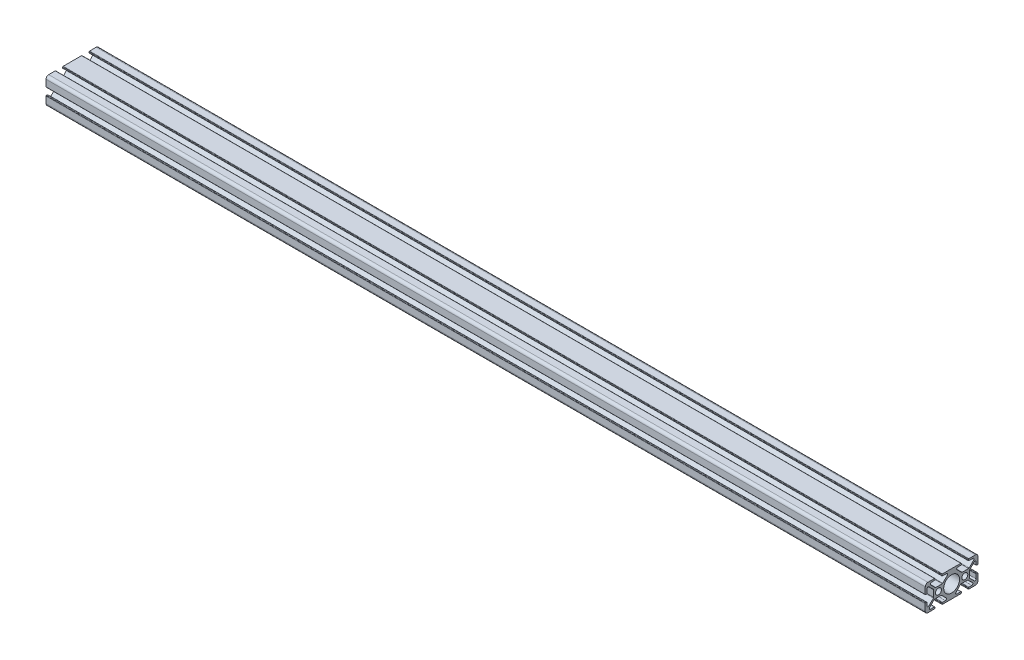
from build123d import *

# Parameters (mm, degrees)
MODEL_R                = 3.4
MODEL_R_2              = 9
STRUKTURBAUTEIL1_DEPTH = 1000


with BuildPart() as part:
    # Model → Strukturbauteil1 (new body)
    with BuildSketch(Plane(origin=(0, 0, 0), x_dir=(0, 0, -1), z_dir=(1, 0, 0))):
        with BuildLine():
            Line((10.77892965, -5.4), (18.02107035, -5.4))
            ThreePointArc((18.02107035, -5.4), (18.403753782, -5.476120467), (18.728177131, -5.692893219))
            Line((18.728177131, -5.692893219), (23.819900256, -10.784616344))
            ThreePointArc((23.819900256, -10.784616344), (24.101215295, -12.198882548), (22.9022583, -13))
            Line((22.9022583, -13), (19.5, -13))
            ThreePointArc((19.5, -13), (19.146446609, -13.146446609), (19, -13.5))
            Line((19, -13.5), (19, -14.5))
            ThreePointArc((19, -14.5), (19.146446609, -14.853553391), (19.5, -15))
            Line((19.5, -15), (27, -15))
            ThreePointArc((27, -15), (29.121320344, -14.121320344), (30, -12))
            Line((30, -12), (30, -4.5))
            ThreePointArc((30, -4.5), (29.853553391, -4.146446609), (29.5, -4))
            Line((29.5, -4), (28.5, -4))
            ThreePointArc((28.5, -4), (28.146446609, -4.146446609), (28, -4.5))
            Line((28, -4.5), (28, -9.1022583))
            ThreePointArc((28, -9.1022583), (27.198882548, -10.301215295), (25.784616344, -10.019900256))
            Line((25.784616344, -10.019900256), (20.692893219, -4.928177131))
            ThreePointArc((20.692893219, -4.928177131), (20.476120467, -4.603753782), (20.4, -4.22107035))
            Line((20.4, -4.22107035), (20.4, 3.02107035))
            ThreePointArc((20.4, 3.02107035), (20.476120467, 3.403753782), (20.692893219, 3.728177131))
            Line((20.692893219, 3.728177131), (25.784616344, 8.819900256))
            ThreePointArc((25.784616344, 8.819900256), (27.198882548, 9.101215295), (28, 7.9022583))
            Line((28, 7.9022583), (28, 4.5))
            ThreePointArc((28, 4.5), (28.146446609, 4.146446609), (28.5, 4))
            Line((28.5, 4), (29.5, 4))
            ThreePointArc((29.5, 4), (29.853553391, 4.146446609), (30, 4.5))
            Line((30, 4.5), (30, 12))
            ThreePointArc((30, 12), (29.121320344, 14.121320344), (27, 15))
            Line((27, 15), (19.5, 15))
            ThreePointArc((19.5, 15), (19.146446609, 14.853553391), (19, 14.5))
            Line((19, 14.5), (19, 13.5))
            ThreePointArc((19, 13.5), (19.146446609, 13.146446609), (19.5, 13))
            Line((19.5, 13), (24.1022583, 13))
            ThreePointArc((24.1022583, 13), (25.301215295, 12.198882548), (25.019900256, 10.784616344))
            Line((25.019900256, 10.784616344), (19.928177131, 5.692893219))
            ThreePointArc((19.928177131, 5.692893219), (19.603753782, 5.476120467), (19.22107035, 5.4))
            Line((19.22107035, 5.4), (11.97892965, 5.4))
            ThreePointArc((11.97892965, 5.4), (11.596246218, 5.476120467), (11.271822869, 5.692893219))
            Line((11.271822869, 5.692893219), (6.180099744, 10.784616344))
            ThreePointArc((6.180099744, 10.784616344), (5.898784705, 12.198882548), (7.0977417, 13))
            Line((7.0977417, 13), (10.5, 13))
            ThreePointArc((10.5, 13), (10.853553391, 13.146446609), (11, 13.5))
            Line((11, 13.5), (11, 14.5))
            ThreePointArc((11, 14.5), (10.853553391, 14.853553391), (10.5, 15))
            Line((10.5, 15), (-10.5, 15))
            ThreePointArc((-10.5, 15), (-10.853553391, 14.853553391), (-11, 14.5))
            Line((-11, 14.5), (-11, 13.5))
            ThreePointArc((-11, 13.5), (-10.853553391, 13.146446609), (-10.5, 13))
            Line((-10.5, 13), (-5.8977417, 13))
            ThreePointArc((-5.8977417, 13), (-4.698784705, 12.198882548), (-4.980099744, 10.784616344))
            Line((-4.980099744, 10.784616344), (-10.071822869, 5.692893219))
            ThreePointArc((-10.071822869, 5.692893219), (-10.396246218, 5.476120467), (-10.77892965, 5.4))
            Line((-10.77892965, 5.4), (-18.02107035, 5.4))
            ThreePointArc((-18.02107035, 5.4), (-18.403753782, 5.476120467), (-18.728177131, 5.692893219))
            Line((-18.728177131, 5.692893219), (-23.819900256, 10.784616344))
            ThreePointArc((-23.819900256, 10.784616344), (-24.101215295, 12.198882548), (-22.9022583, 13))
            Line((-22.9022583, 13), (-19.5, 13))
            ThreePointArc((-19.5, 13), (-19.146446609, 13.146446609), (-19, 13.5))
            Line((-19, 13.5), (-19, 14.5))
            ThreePointArc((-19, 14.5), (-19.146446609, 14.853553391), (-19.5, 15))
            Line((-19.5, 15), (-27, 15))
            ThreePointArc((-27, 15), (-29.121320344, 14.121320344), (-30, 12))
            Line((-30, 12), (-30, 4.5))
            ThreePointArc((-30, 4.5), (-29.853553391, 4.146446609), (-29.5, 4))
            Line((-29.5, 4), (-28.5, 4))
            ThreePointArc((-28.5, 4), (-28.146446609, 4.146446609), (-28, 4.5))
            Line((-28, 4.5), (-28, 9.1022583))
            ThreePointArc((-28, 9.1022583), (-27.198882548, 10.301215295), (-25.784616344, 10.019900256))
            Line((-25.784616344, 10.019900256), (-20.692893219, 4.928177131))
            ThreePointArc((-20.692893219, 4.928177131), (-20.476120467, 4.603753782), (-20.4, 4.22107035))
            Line((-20.4, 4.22107035), (-20.4, -3.02107035))
            ThreePointArc((-20.4, -3.02107035), (-20.476120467, -3.403753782), (-20.692893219, -3.728177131))
            Line((-20.692893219, -3.728177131), (-25.784616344, -8.819900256))
            ThreePointArc((-25.784616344, -8.819900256), (-27.198882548, -9.101215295), (-28, -7.9022583))
            Line((-28, -7.9022583), (-28, -4.5))
            ThreePointArc((-28, -4.5), (-28.146446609, -4.146446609), (-28.5, -4))
            Line((-28.5, -4), (-29.5, -4))
            ThreePointArc((-29.5, -4), (-29.853553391, -4.146446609), (-30, -4.5))
            Line((-30, -4.5), (-30, -12))
            ThreePointArc((-30, -12), (-29.121320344, -14.121320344), (-27, -15))
            Line((-27, -15), (-19.5, -15))
            ThreePointArc((-19.5, -15), (-19.146446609, -14.853553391), (-19, -14.5))
            Line((-19, -14.5), (-19, -13.5))
            ThreePointArc((-19, -13.5), (-19.146446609, -13.146446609), (-19.5, -13))
            Line((-19.5, -13), (-24.1022583, -13))
            ThreePointArc((-24.1022583, -13), (-25.301215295, -12.198882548), (-25.019900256, -10.784616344))
            Line((-25.019900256, -10.784616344), (-19.928177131, -5.692893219))
            ThreePointArc((-19.928177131, -5.692893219), (-19.603753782, -5.476120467), (-19.22107035, -5.4))
            Line((-19.22107035, -5.4), (-11.97892965, -5.4))
            ThreePointArc((-11.97892965, -5.4), (-11.596246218, -5.476120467), (-11.271822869, -5.692893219))
            Line((-11.271822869, -5.692893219), (-6.180099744, -10.784616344))
            ThreePointArc((-6.180099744, -10.784616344), (-5.898784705, -12.198882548), (-7.0977417, -13))
            Line((-7.0977417, -13), (-10.5, -13))
            ThreePointArc((-10.5, -13), (-10.853553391, -13.146446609), (-11, -13.5))
            Line((-11, -13.5), (-11, -14.5))
            ThreePointArc((-11, -14.5), (-10.853553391, -14.853553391), (-10.5, -15))
            Line((-10.5, -15), (10.5, -15))
            ThreePointArc((10.5, -15), (10.853553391, -14.853553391), (11, -14.5))
            Line((11, -14.5), (11, -13.5))
            ThreePointArc((11, -13.5), (10.853553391, -13.146446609), (10.5, -13))
            Line((10.5, -13), (5.8977417, -13))
            ThreePointArc((5.8977417, -13), (4.698784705, -12.198882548), (4.980099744, -10.784616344))
            Line((4.980099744, -10.784616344), (10.071822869, -5.692893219))
            ThreePointArc((10.071822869, -5.692893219), (10.396246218, -5.476120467), (10.77892965, -5.4))
        make_face()
        with Locations((-15, 0)):
            Circle(MODEL_R, mode=Mode.SUBTRACT)
        with Locations((15, 0)):
            Circle(MODEL_R, mode=Mode.SUBTRACT)
        Circle(MODEL_R_2, mode=Mode.SUBTRACT)
    extrude(amount=STRUKTURBAUTEIL1_DEPTH)


solid = part.part
